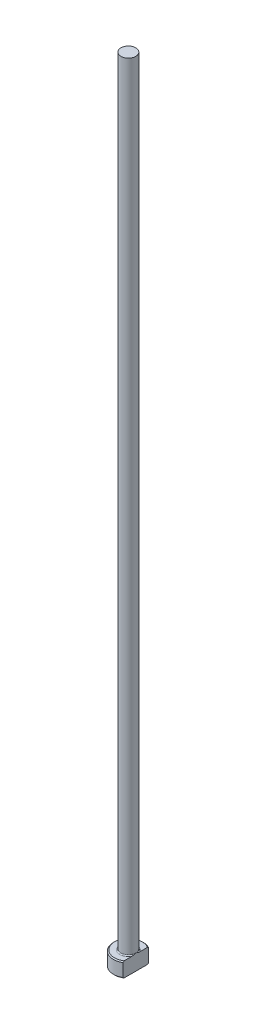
from build123d import *
from build123d.topology import SkipClean

# Parameters (mm, degrees)
CHAMFER1_SIZE = 0.2
FILLET1_R     = 0.2
KEY_DEPTH     = 161.056240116


with BuildPart() as part:
    # Sketch1 → Revolve1 (revolve)
    with BuildSketch(Plane.XY, mode=Mode.PRIVATE) as revolve1_sk:
        Polygon((0, 0), (-3, 0), (-3, 3), (-1.5, 3), (-1.5, 160), (0, 160), align=None)
    revolve(revolve1_sk.sketch.rotate(Axis((0, 259.958771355, 0), (0, -1, 0)), 270), axis=Axis((0, 259.958771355, 0), (0, -1, 0)))

    # Chamfer1
    chamfer1_edges = [part.edges().sort_by_distance(p)[0] for p in [
        (0, 3, -3),
        (0, 0, -3),
    ]]
    chamfer(chamfer1_edges, length=CHAMFER1_SIZE)

    # Fillet1
    fillet1_edges = [part.edges().sort_by_distance(p)[0] for p in [
        (0, 3, -1.5),
    ]]
    fillet(fillet1_edges, radius=FILLET1_R)

    # Sketch2 → KEY (cut, through all)
    with SkipClean():  # the faces are left unmerged after this step: merging them gives an invalid solid
        with BuildSketch(Plane(origin=(0, 0, 0), x_dir=(1, 0, 0), z_dir=(0, 1, 0))):
            with BuildLine():
                Line((1.5, 2.598076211), (1.5, -2.598076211))
                ThreePointArc((1.5, -2.598076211), (3, 0), (1.5, 2.598076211))
            make_face()
        extrude(amount=KEY_DEPTH, mode=Mode.SUBTRACT)


solid = part.part
